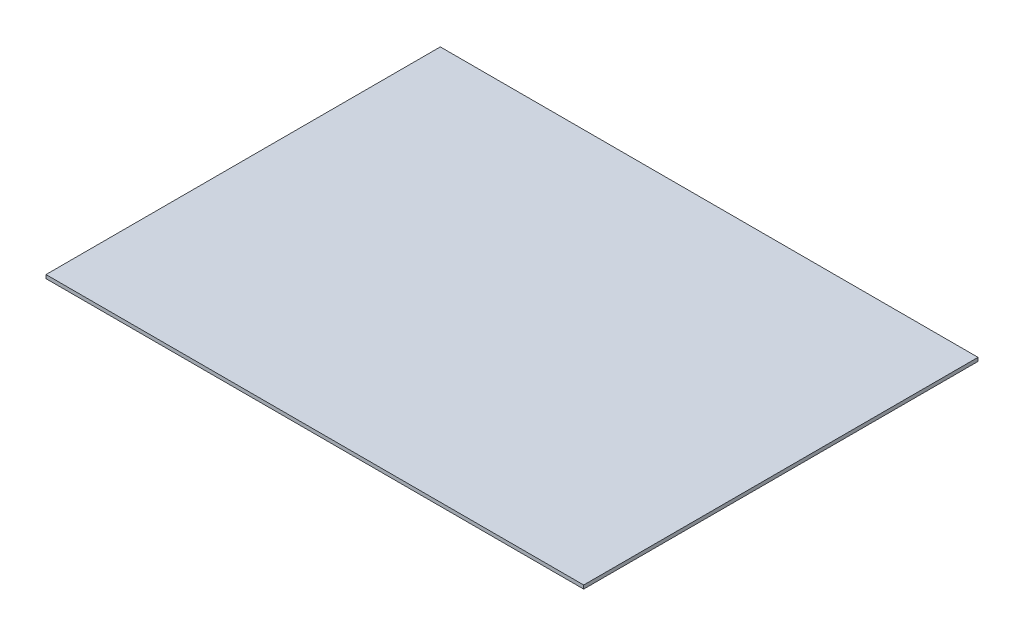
from build123d import *

# Parameters (mm, degrees)
SKETCH1_W           = 114.3
SKETCH1_H           = 83.82
BOSS_EXTRUDE1_DEPTH = 0.762


with BuildPart() as part:
    # Sketch1 → Boss-Extrude1 (new body)
    with BuildSketch(Plane(origin=(0, 0, 0), x_dir=(1, 0, 0), z_dir=(0, 1, 0))):
        with Locations((57.15, 41.91)):
            Rectangle(SKETCH1_W, SKETCH1_H)
    extrude(amount=BOSS_EXTRUDE1_DEPTH)


solid = part.part
